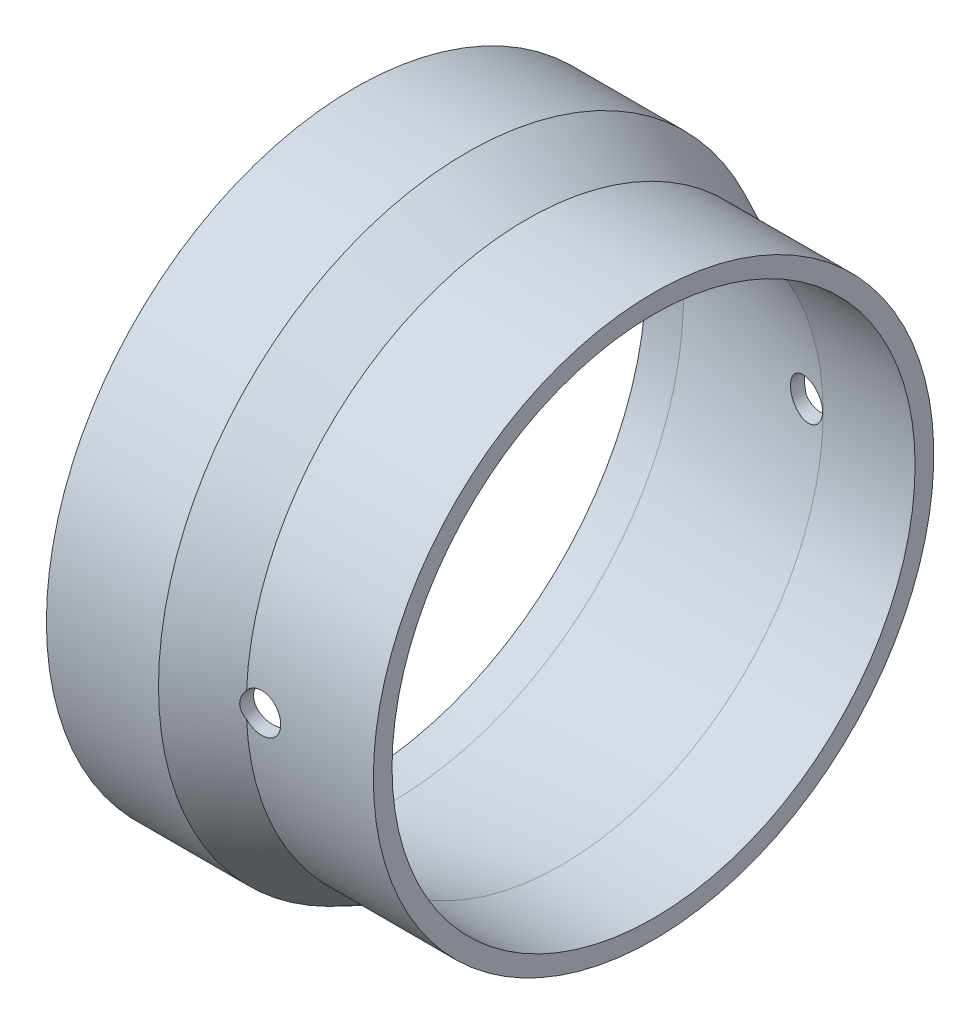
ISO-10303-21;
HEADER;
FILE_DESCRIPTION(('STEP AP214'),'2;1');
FILE_NAME('part.step','',(''),(''),'','','');
FILE_SCHEMA(('AUTOMOTIVE_DESIGN { 1 0 10303 214 1 1 1 1 }'));
ENDSEC;
DATA;
#1=APPLICATION_CONTEXT('core data for automotive mechanical design processes');
#2=APPLICATION_PROTOCOL_DEFINITION('international standard','automotive_design',2000,#1);
#3=PRODUCT_CONTEXT('',#1,'mechanical');
#4=PRODUCT('Part','Part','',(#3));
#5=PRODUCT_RELATED_PRODUCT_CATEGORY('part','',(#4));
#6=PRODUCT_DEFINITION_FORMATION('','',#4);
#7=PRODUCT_DEFINITION_CONTEXT('part definition',#1,'design');
#8=PRODUCT_DEFINITION('design','',#6,#7);
#9=PRODUCT_DEFINITION_SHAPE('','',#8);
#10=(LENGTH_UNIT() NAMED_UNIT(*) SI_UNIT(.MILLI.,.METRE.));
#11=(NAMED_UNIT(*) PLANE_ANGLE_UNIT() SI_UNIT($,.RADIAN.));
#12=(NAMED_UNIT(*) SI_UNIT($,.STERADIAN.) SOLID_ANGLE_UNIT());
#13=UNCERTAINTY_MEASURE_WITH_UNIT(LENGTH_MEASURE(1.E-05),#10,'distance_accuracy_value','');
#14=(GEOMETRIC_REPRESENTATION_CONTEXT(3) GLOBAL_UNCERTAINTY_ASSIGNED_CONTEXT((#13)) GLOBAL_UNIT_ASSIGNED_CONTEXT((#10,
#11,#12)) REPRESENTATION_CONTEXT('',''));
#15=CARTESIAN_POINT('',(0.,0.,0.));
#16=DIRECTION('',(0.,0.,1.));
#17=DIRECTION('',(1.,0.,0.));
#18=AXIS2_PLACEMENT_3D('',#15,#16,#17);
#19=CARTESIAN_POINT('',(-26.3725469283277,0.,0.));
#20=DIRECTION('',(-1.,0.,0.));
#21=DIRECTION('',(0.,0.,1.));
#22=AXIS2_PLACEMENT_3D('',#19,#20,#21);
#23=CYLINDRICAL_SURFACE('',#22,26.19375);
#24=CARTESIAN_POINT('',(0.,0.,0.));
#25=DIRECTION('',(-1.,0.,0.));
#26=DIRECTION('',(0.,0.,1.));
#27=AXIS2_PLACEMENT_3D('',#24,#25,#26);
#28=CIRCLE('',#27,26.19375);
#29=CARTESIAN_POINT('',(0.,0.,26.19375));
#30=VERTEX_POINT('',#29);
#31=EDGE_CURVE('E72',#30,#30,#28,.T.);
#32=ORIENTED_EDGE('',*,*,#31,.F.);
#33=EDGE_LOOP('',(#32));
#34=FACE_BOUND('',#33,.T.);
#35=CARTESIAN_POINT('',(9.525,0.,0.));
#36=DIRECTION('',(-1.,0.,0.));
#37=DIRECTION('',(0.,0.,1.));
#38=AXIS2_PLACEMENT_3D('',#35,#36,#37);
#39=CIRCLE('',#38,26.19375);
#40=CARTESIAN_POINT('',(9.525,0.,26.19375));
#41=VERTEX_POINT('',#40);
#42=EDGE_CURVE('E86',#41,#41,#39,.T.);
#43=ORIENTED_EDGE('',*,*,#42,.T.);
#44=EDGE_LOOP('',(#43));
#45=FACE_BOUND('',#44,.T.);
#46=ADVANCED_FACE('F36',(#34,#45),#23,.T.);
#47=CARTESIAN_POINT('',(0.,26.19375,0.));
#48=DIRECTION('',(1.,0.,0.));
#49=DIRECTION('',(0.,0.,-1.));
#50=AXIS2_PLACEMENT_3D('',#47,#48,#49);
#51=PLANE('',#50);
#52=CARTESIAN_POINT('',(0.,0.,0.));
#53=DIRECTION('',(-1.,0.,0.));
#54=DIRECTION('',(0.,0.,1.));
#55=AXIS2_PLACEMENT_3D('',#52,#53,#54);
#56=CIRCLE('',#55,24.765);
#57=CARTESIAN_POINT('',(0.,0.,24.765));
#58=VERTEX_POINT('',#57);
#59=EDGE_CURVE('E98',#58,#58,#56,.T.);
#60=ORIENTED_EDGE('',*,*,#59,.F.);
#61=EDGE_LOOP('',(#60));
#62=FACE_BOUND('',#61,.T.);
#63=ORIENTED_EDGE('',*,*,#31,.T.);
#64=EDGE_LOOP('',(#63));
#65=FACE_BOUND('',#64,.T.);
#66=ADVANCED_FACE('F147',(#62,#65),#51,.F.);
#67=CARTESIAN_POINT('',(-26.3725469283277,0.,0.));
#68=DIRECTION('',(-1.,0.,0.));
#69=DIRECTION('',(0.,0.,1.));
#70=AXIS2_PLACEMENT_3D('',#67,#68,#69);
#71=CYLINDRICAL_SURFACE('',#70,24.765);
#72=CARTESIAN_POINT('',(3.175,0.,0.));
#73=DIRECTION('',(-1.,0.,0.));
#74=DIRECTION('',(0.,0.,1.));
#75=AXIS2_PLACEMENT_3D('',#72,#73,#74);
#76=CIRCLE('',#75,24.765);
#77=CARTESIAN_POINT('',(3.175,0.,24.765));
#78=VERTEX_POINT('',#77);
#79=EDGE_CURVE('E95',#78,#78,#76,.T.);
#80=ORIENTED_EDGE('',*,*,#79,.F.);
#81=EDGE_LOOP('',(#80));
#82=FACE_BOUND('',#81,.T.);
#83=ORIENTED_EDGE('',*,*,#59,.T.);
#84=EDGE_LOOP('',(#83));
#85=FACE_BOUND('',#84,.T.);
#86=ADVANCED_FACE('F142',(#82,#85),#71,.F.);
#87=CARTESIAN_POINT('',(3.175,0.,0.));
#88=DIRECTION('',(-1.,0.,0.));
#89=DIRECTION('',(0.,0.,1.));
#90=AXIS2_PLACEMENT_3D('',#87,#88,#89);
#91=CONICAL_SURFACE('',#90,24.765,0.174532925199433);
#92=CARTESIAN_POINT('',(14.5232093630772,-0.947872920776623,-22.744261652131));
#93=CARTESIAN_POINT('',(14.4712327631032,-0.87374165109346,-22.7565234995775));
#94=CARTESIAN_POINT('',(14.425239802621,-0.795144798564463,-22.767546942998));
#95=CARTESIAN_POINT('',(14.3466697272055,-0.631102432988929,-22.7865438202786));
#96=CARTESIAN_POINT('',(14.3141037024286,-0.54565132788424,-22.794514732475));
#97=CARTESIAN_POINT('',(14.2634653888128,-0.370255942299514,-22.806968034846));
#98=CARTESIAN_POINT('',(14.2453999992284,-0.280309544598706,-22.8114487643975));
#99=CARTESIAN_POINT('',(14.2244097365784,-0.0985780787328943,-22.8166588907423));
#100=CARTESIAN_POINT('',(14.2214813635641,-0.00679344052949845,-22.8173891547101));
#101=CARTESIAN_POINT('',(14.230793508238,0.174764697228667,-22.8150743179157));
#102=CARTESIAN_POINT('',(14.2428393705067,0.26454887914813,-22.8120776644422));
#103=CARTESIAN_POINT('',(14.2813685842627,0.44076642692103,-22.8025585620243));
#104=CARTESIAN_POINT('',(14.3078523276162,0.527199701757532,-22.7960360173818));
#105=CARTESIAN_POINT('',(14.37449664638,0.6945700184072,-22.779795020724));
#106=CARTESIAN_POINT('',(14.4146947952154,0.775491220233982,-22.7700677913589));
#107=CARTESIAN_POINT('',(14.5075176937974,0.929449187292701,-22.747922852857));
#108=CARTESIAN_POINT('',(14.5601437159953,1.00248514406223,-22.7355048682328));
#109=CARTESIAN_POINT('',(14.6776048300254,1.14036356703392,-22.7082738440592));
#110=CARTESIAN_POINT('',(14.7426860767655,1.2049869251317,-22.6934135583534));
#111=CARTESIAN_POINT('',(14.8824109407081,1.32246066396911,-22.6621922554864));
#112=CARTESIAN_POINT('',(14.9570558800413,1.37530941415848,-22.6458310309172));
#113=CARTESIAN_POINT('',(15.115888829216,1.46910525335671,-22.6118771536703));
#114=CARTESIAN_POINT('',(15.2002707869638,1.50971667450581,-22.59426379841));
#115=CARTESIAN_POINT('',(15.3746540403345,1.57612232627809,-22.5589056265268));
#116=CARTESIAN_POINT('',(15.4646557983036,1.60191533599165,-22.5411607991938));
#117=CARTESIAN_POINT('',(15.6489220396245,1.63817294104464,-22.5059783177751));
#118=CARTESIAN_POINT('',(15.7432246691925,1.64845023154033,-22.4885468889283));
#119=CARTESIAN_POINT('',(15.9323973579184,1.65271197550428,-22.4547878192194));
#120=CARTESIAN_POINT('',(16.0272674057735,1.64669675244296,-22.4384601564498));
#121=CARTESIAN_POINT('',(16.2143187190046,1.61850574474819,-22.4074430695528));
#122=CARTESIAN_POINT('',(16.3065117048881,1.59641708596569,-22.3927453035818));
#123=CARTESIAN_POINT('',(16.4860087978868,1.53668920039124,-22.3651984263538));
#124=CARTESIAN_POINT('',(16.5733132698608,1.49905113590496,-22.3523491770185));
#125=CARTESIAN_POINT('',(16.7392233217,1.40984644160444,-22.3288387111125));
#126=CARTESIAN_POINT('',(16.8179329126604,1.35848060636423,-22.3181495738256));
#127=CARTESIAN_POINT('',(16.9656549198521,1.24300445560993,-22.2987905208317));
#128=CARTESIAN_POINT('',(17.0346679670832,1.1788949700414,-22.2901204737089));
#129=CARTESIAN_POINT('',(17.1601516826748,1.04057840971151,-22.2748524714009));
#130=CARTESIAN_POINT('',(17.2167607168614,0.966499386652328,-22.2682312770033));
#131=CARTESIAN_POINT('',(17.3167699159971,0.809777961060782,-22.2568346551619));
#132=CARTESIAN_POINT('',(17.3601705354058,0.727135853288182,-22.2520591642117));
#133=CARTESIAN_POINT('',(17.4322496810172,0.556173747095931,-22.2442727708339));
#134=CARTESIAN_POINT('',(17.4610150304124,0.467890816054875,-22.2412514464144));
#135=CARTESIAN_POINT('',(17.5033683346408,0.287717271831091,-22.2368429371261));
#136=CARTESIAN_POINT('',(17.5169564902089,0.195826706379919,-22.2354557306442));
#137=CARTESIAN_POINT('',(17.5285444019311,0.0112430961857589,-22.2342711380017));
#138=CARTESIAN_POINT('',(17.5265752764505,-0.0814479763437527,-22.2344705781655));
#139=CARTESIAN_POINT('',(17.5071805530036,-0.265181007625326,-22.2364584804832));
#140=CARTESIAN_POINT('',(17.4897550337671,-0.35622297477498,-22.2382469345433));
#141=CARTESIAN_POINT('',(17.4399646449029,-0.534050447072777,-22.2434691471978));
#142=CARTESIAN_POINT('',(17.4076036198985,-0.62083704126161,-22.2469024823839));
#143=CARTESIAN_POINT('',(17.3288936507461,-0.787721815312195,-22.2555063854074));
#144=CARTESIAN_POINT('',(17.2825447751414,-0.867820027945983,-22.2606769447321));
#145=CARTESIAN_POINT('',(17.177167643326,-1.01915178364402,-22.2728629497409));
#146=CARTESIAN_POINT('',(17.1181265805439,-1.09037625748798,-22.279880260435));
#147=CARTESIAN_POINT('',(16.9891304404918,-1.22188310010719,-22.2958352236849));
#148=CARTESIAN_POINT('',(16.9191752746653,-1.28216538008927,-22.3047728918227));
#149=CARTESIAN_POINT('',(16.7701129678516,-1.39035500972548,-22.3246259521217));
#150=CARTESIAN_POINT('',(16.6909720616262,-1.43821446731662,-22.3355487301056));
#151=CARTESIAN_POINT('',(16.5260550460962,-1.52000044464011,-22.3592788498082));
#152=CARTESIAN_POINT('',(16.4402786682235,-1.5539264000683,-22.3720862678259));
#153=CARTESIAN_POINT('',(16.2637401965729,-1.60725260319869,-22.3995275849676));
#154=CARTESIAN_POINT('',(16.1729400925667,-1.6265189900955,-22.4141769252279));
#155=CARTESIAN_POINT('',(15.9896375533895,-1.64960428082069,-22.4448982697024));
#156=CARTESIAN_POINT('',(15.8971350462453,-1.65342253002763,-22.4609703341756));
#157=CARTESIAN_POINT('',(15.7117058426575,-1.64555908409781,-22.4943314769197));
#158=CARTESIAN_POINT('',(15.6187906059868,-1.63366499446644,-22.5116341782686));
#159=CARTESIAN_POINT('',(15.4363530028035,-1.59439612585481,-22.5466983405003));
#160=CARTESIAN_POINT('',(15.3468317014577,-1.5670165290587,-22.5644599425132));
#161=CARTESIAN_POINT('',(15.1726439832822,-1.49713346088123,-22.59998617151));
#162=CARTESIAN_POINT('',(15.0880464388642,-1.45445717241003,-22.6177484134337));
#163=CARTESIAN_POINT('',(14.9273057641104,-1.35520491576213,-22.6523051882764));
#164=CARTESIAN_POINT('',(14.8511535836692,-1.29864403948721,-22.6691007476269));
#165=CARTESIAN_POINT('',(14.7321494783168,-1.19324974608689,-22.6958574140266));
#166=CARTESIAN_POINT('',(14.686432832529,-1.14772314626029,-22.7062873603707));
#167=CARTESIAN_POINT('',(14.6005293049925,-1.05151501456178,-22.7261094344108));
#168=CARTESIAN_POINT('',(14.5603423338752,-1.00083356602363,-22.735501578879));
#169=CARTESIAN_POINT('',(14.5232093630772,-0.947872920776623,-22.744261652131));
#170=B_SPLINE_CURVE_WITH_KNOTS('',3,(#92,#93,#94,#95,#96,#97,#98,#99,#100,#101,#102,#103,#104,
#105,#106,#107,#108,#109,#110,#111,#112,#113,#114,#115,#116,#117,#118,#119,#120,#121,#122,#123,
#124,#125,#126,#127,#128,#129,#130,#131,#132,#133,#134,#135,#136,#137,#138,#139,#140,#141,#142,
#143,#144,#145,#146,#147,#148,#149,#150,#151,#152,#153,#154,#155,#156,#157,#158,#159,#160,#161,
#162,#163,#164,#165,#166,#167,#168,#169),.UNSPECIFIED.,.T.,.F.,(4,2,2,2,2,2,2,2,2,2,2,2,2,2,2,2,
2,2,2,2,2,2,2,2,2,2,2,2,2,2,2,2,2,2,2,2,2,2,4),(0.,0.273861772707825,0.547949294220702,
0.822167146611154,1.09632159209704,1.36694918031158,1.63758411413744,1.90896654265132,
2.18037676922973,2.4578411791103,2.73534398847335,3.01988147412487,3.3044423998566,
3.59241180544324,3.88037549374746,4.16678979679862,4.45318269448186,4.73559634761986,
5.01799161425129,5.29705526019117,5.57610930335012,5.85348797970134,6.13086298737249,
6.40768331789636,6.68450223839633,6.96124994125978,7.23799628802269,7.51502319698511,
7.79205235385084,8.07013415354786,8.34822721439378,8.62883012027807,8.90944491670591,
9.19389206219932,9.47842775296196,9.76628496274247,10.0538306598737,10.2494853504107,
10.4451368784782),.UNSPECIFIED.);
#171=CARTESIAN_POINT('',(14.5232093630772,-0.947872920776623,-22.744261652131));
#172=VERTEX_POINT('',#171);
#173=EDGE_CURVE('E132',#172,#172,#170,.T.);
#174=ORIENTED_EDGE('',*,*,#173,.T.);
#175=EDGE_LOOP('',(#174));
#176=FACE_BOUND('',#175,.T.);
#177=CARTESIAN_POINT('',(14.5232093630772,-0.947872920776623,22.744261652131));
#178=CARTESIAN_POINT('',(14.5771465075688,-1.0247867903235,22.7315371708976));
#179=CARTESIAN_POINT('',(14.6376028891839,-1.09699957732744,22.7174614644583));
#180=CARTESIAN_POINT('',(14.7696904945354,-1.23000058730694,22.6873252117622));
#181=CARTESIAN_POINT('',(14.8413381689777,-1.29077169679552,22.6712617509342));
#182=CARTESIAN_POINT('',(14.9935898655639,-1.39915458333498,22.6379339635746));
#183=CARTESIAN_POINT('',(15.0741822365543,-1.4467832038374,22.6206712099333));
#184=CARTESIAN_POINT('',(15.2421271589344,-1.52773108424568,22.5856680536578));
#185=CARTESIAN_POINT('',(15.3294778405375,-1.56105428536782,22.5679277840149));
#186=CARTESIAN_POINT('',(15.5096652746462,-1.61283055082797,22.5324342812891));
#187=CARTESIAN_POINT('',(15.6025554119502,-1.63109977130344,22.514683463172));
#188=CARTESIAN_POINT('',(15.7902513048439,-1.65152371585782,22.4800097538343));
#189=CARTESIAN_POINT('',(15.8850571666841,-1.65367754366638,22.4630869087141));
#190=CARTESIAN_POINT('',(16.0737320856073,-1.64171485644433,22.4306070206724));
#191=CARTESIAN_POINT('',(16.1676023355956,-1.62762276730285,22.4150479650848));
#192=CARTESIAN_POINT('',(16.3517971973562,-1.58348737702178,22.3856493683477));
#193=CARTESIAN_POINT('',(16.4421220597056,-1.55344520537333,22.3718097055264));
#194=CARTESIAN_POINT('',(16.615379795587,-1.47865709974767,22.3462593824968));
#195=CARTESIAN_POINT('',(16.6983930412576,-1.43410598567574,22.3345235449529));
#196=CARTESIAN_POINT('',(16.8558199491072,-1.33139930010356,22.3130729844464));
#197=CARTESIAN_POINT('',(16.930234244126,-1.27324473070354,22.3033581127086));
#198=CARTESIAN_POINT('',(17.0672970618,-1.14580642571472,22.2860655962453));
#199=CARTESIAN_POINT('',(17.1300858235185,-1.07667701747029,22.2784618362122));
#200=CARTESIAN_POINT('',(17.2431954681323,-0.928715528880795,22.2651581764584));
#201=CARTESIAN_POINT('',(17.293516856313,-0.849883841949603,22.2594581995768));
#202=CARTESIAN_POINT('',(17.3798599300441,-0.685392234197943,22.2498957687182));
#203=CARTESIAN_POINT('',(17.415984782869,-0.599787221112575,22.2460200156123));
#204=CARTESIAN_POINT('',(17.4733964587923,-0.423682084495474,22.2399453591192));
#205=CARTESIAN_POINT('',(17.4946835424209,-0.333182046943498,22.2377464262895));
#206=CARTESIAN_POINT('',(17.5217549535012,-0.150122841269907,22.2349609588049));
#207=CARTESIAN_POINT('',(17.5275816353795,-0.0575700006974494,22.2343700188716));
#208=CARTESIAN_POINT('',(17.5236840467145,0.127204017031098,22.2347679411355));
#209=CARTESIAN_POINT('',(17.5139598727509,0.219425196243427,22.2357567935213));
#210=CARTESIAN_POINT('',(17.4792555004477,0.400863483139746,22.2393461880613));
#211=CARTESIAN_POINT('',(17.4542839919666,0.490082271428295,22.2419458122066));
#212=CARTESIAN_POINT('',(17.3898248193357,0.663041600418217,22.2488330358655));
#213=CARTESIAN_POINT('',(17.3503372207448,0.746782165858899,22.2531206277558));
#214=CARTESIAN_POINT('',(17.2579765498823,0.906471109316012,22.2634876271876));
#215=CARTESIAN_POINT('',(17.2050950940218,0.982414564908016,22.2695681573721));
#216=CARTESIAN_POINT('',(17.0875155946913,1.12432103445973,22.2836140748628));
#217=CARTESIAN_POINT('',(17.0228175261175,1.19028402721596,22.2915794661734));
#218=CARTESIAN_POINT('',(16.8833015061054,1.31058677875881,22.3094738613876));
#219=CARTESIAN_POINT('',(16.8084550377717,1.3648926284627,22.3194084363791));
#220=CARTESIAN_POINT('',(16.6509727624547,1.46018446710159,22.34120487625));
#221=CARTESIAN_POINT('',(16.5683367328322,1.50117007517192,22.3530667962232));
#222=CARTESIAN_POINT('',(16.3970043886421,1.56903357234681,22.3786911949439));
#223=CARTESIAN_POINT('',(16.3082670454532,1.5958026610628,22.3924673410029));
#224=CARTESIAN_POINT('',(16.1278200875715,1.63413363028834,22.4216049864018));
#225=CARTESIAN_POINT('',(16.0361102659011,1.64569444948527,22.4369665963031));
#226=CARTESIAN_POINT('',(15.8510654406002,1.65345517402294,22.4691128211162));
#227=CARTESIAN_POINT('',(15.7577247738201,1.64945415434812,22.4859132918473));
#228=CARTESIAN_POINT('',(15.5731776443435,1.62584143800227,22.5202582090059));
#229=CARTESIAN_POINT('',(15.4819713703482,1.60622836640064,22.5378027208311));
#230=CARTESIAN_POINT('',(15.3030233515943,1.55161428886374,22.5732566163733));
#231=CARTESIAN_POINT('',(15.2153415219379,1.51641792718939,22.591167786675));
#232=CARTESIAN_POINT('',(15.0471532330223,1.43155292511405,22.6264192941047));
#233=CARTESIAN_POINT('',(14.9666470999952,1.3818836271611,22.6437596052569));
#234=CARTESIAN_POINT('',(14.8149702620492,1.26928098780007,22.6771368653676));
#235=CARTESIAN_POINT('',(14.7438162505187,1.20632443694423,22.6931714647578));
#236=CARTESIAN_POINT('',(14.6131423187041,1.06888032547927,22.723126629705));
#237=CARTESIAN_POINT('',(14.5536214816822,0.99439367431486,22.7370473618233));
#238=CARTESIAN_POINT('',(14.4489725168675,0.837263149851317,22.7618354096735));
#239=CARTESIAN_POINT('',(14.4036232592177,0.754774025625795,22.7727492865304));
#240=CARTESIAN_POINT('',(14.3274996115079,0.58297964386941,22.7912209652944));
#241=CARTESIAN_POINT('',(14.2967220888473,0.493675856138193,22.7987794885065));
#242=CARTESIAN_POINT('',(14.2514213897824,0.313371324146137,22.8099491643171));
#243=CARTESIAN_POINT('',(14.2364825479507,0.222481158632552,22.8136612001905));
#244=CARTESIAN_POINT('',(14.2219176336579,0.0393864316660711,22.8172799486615));
#245=CARTESIAN_POINT('',(14.2222934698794,-0.0528182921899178,22.817186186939));
#246=CARTESIAN_POINT('',(14.2382063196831,-0.23422632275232,22.8132333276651));
#247=CARTESIAN_POINT('',(14.253485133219,-0.323454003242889,22.8094383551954));
#248=CARTESIAN_POINT('',(14.298310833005,-0.497944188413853,22.7983898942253));
#249=CARTESIAN_POINT('',(14.3278409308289,-0.583211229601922,22.7911404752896));
#250=CARTESIAN_POINT('',(14.3858605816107,-0.714995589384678,22.7770581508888));
#251=CARTESIAN_POINT('',(14.4101525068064,-0.763513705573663,22.7711921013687));
#252=CARTESIAN_POINT('',(14.4633137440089,-0.857830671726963,22.7584536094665));
#253=CARTESIAN_POINT('',(14.492182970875,-0.903629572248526,22.7515811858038));
#254=CARTESIAN_POINT('',(14.5232093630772,-0.947872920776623,22.744261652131));
#255=B_SPLINE_CURVE_WITH_KNOTS('',3,(#177,#178,#179,#180,#181,#182,#183,#184,#185,#186,#187,
#188,#189,#190,#191,#192,#193,#194,#195,#196,#197,#198,#199,#200,#201,#202,#203,#204,#205,#206,
#207,#208,#209,#210,#211,#212,#213,#214,#215,#216,#217,#218,#219,#220,#221,#222,#223,#224,#225,
#226,#227,#228,#229,#230,#231,#232,#233,#234,#235,#236,#237,#238,#239,#240,#241,#242,#243,#244,
#245,#246,#247,#248,#249,#250,#251,#252,#253,#254),.UNSPECIFIED.,.T.,.F.,(4,2,2,2,2,2,2,2,2,2,2,
2,2,2,2,2,2,2,2,2,2,2,2,2,2,2,2,2,2,2,2,2,2,2,2,2,2,2,4),(0.,0.284193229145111,
0.568808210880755,0.853056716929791,1.13722686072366,1.4248179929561,1.71242511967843,
1.9996003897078,2.28675532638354,2.57020332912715,2.85363045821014,3.13337706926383,
3.41311234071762,3.69077540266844,3.96843358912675,4.24533033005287,4.52222535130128,
4.7989627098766,5.07569881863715,5.35260857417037,5.62951891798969,5.90722415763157,
6.18493733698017,6.46474632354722,6.74457483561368,7.02802824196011,7.31150661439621,
7.59864405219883,7.88579453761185,8.17345081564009,8.46108441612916,8.74397542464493,
9.0268055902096,9.30201416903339,9.57725704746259,9.8478144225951,10.1180538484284,
10.281534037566,10.445011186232),.UNSPECIFIED.);
#256=CARTESIAN_POINT('',(14.5232093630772,-0.947872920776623,22.744261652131));
#257=VERTEX_POINT('',#256);
#258=EDGE_CURVE('E126',#257,#257,#255,.T.);
#259=ORIENTED_EDGE('',*,*,#258,.T.);
#260=EDGE_LOOP('',(#259));
#261=FACE_BOUND('',#260,.T.);
#262=CARTESIAN_POINT('',(17.580055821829,0.,0.));
#263=DIRECTION('',(-1.,0.,0.));
#264=DIRECTION('',(0.,0.,1.));
#265=AXIS2_PLACEMENT_3D('',#262,#263,#264);
#266=CIRCLE('',#265,22.225);
#267=CARTESIAN_POINT('',(17.580055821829,0.,22.225));
#268=VERTEX_POINT('',#267);
#269=EDGE_CURVE('E92',#268,#268,#266,.T.);
#270=ORIENTED_EDGE('',*,*,#269,.F.);
#271=EDGE_LOOP('',(#270));
#272=FACE_BOUND('',#271,.T.);
#273=ORIENTED_EDGE('',*,*,#79,.T.);
#274=EDGE_LOOP('',(#273));
#275=FACE_BOUND('',#274,.T.);
#276=ADVANCED_FACE('F136',(#176,#261,#272,#275),#91,.F.);
#277=CARTESIAN_POINT('',(-26.3725469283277,0.,0.));
#278=DIRECTION('',(-1.,0.,0.));
#279=DIRECTION('',(0.,0.,1.));
#280=AXIS2_PLACEMENT_3D('',#277,#278,#279);
#281=CYLINDRICAL_SURFACE('',#280,22.225);
#282=CARTESIAN_POINT('',(25.4,0.,0.));
#283=DIRECTION('',(-1.,0.,0.));
#284=DIRECTION('',(0.,0.,1.));
#285=AXIS2_PLACEMENT_3D('',#282,#283,#284);
#286=CIRCLE('',#285,22.225);
#287=CARTESIAN_POINT('',(25.4,0.,22.225));
#288=VERTEX_POINT('',#287);
#289=EDGE_CURVE('E84',#288,#288,#286,.T.);
#290=ORIENTED_EDGE('',*,*,#289,.F.);
#291=EDGE_LOOP('',(#290));
#292=FACE_BOUND('',#291,.T.);
#293=ORIENTED_EDGE('',*,*,#269,.T.);
#294=EDGE_LOOP('',(#293));
#295=FACE_BOUND('',#294,.T.);
#296=ADVANCED_FACE('F141',(#292,#295),#281,.F.);
#297=CARTESIAN_POINT('',(25.4,22.225,0.));
#298=DIRECTION('',(-1.,0.,0.));
#299=DIRECTION('',(0.,0.,1.));
#300=AXIS2_PLACEMENT_3D('',#297,#298,#299);
#301=PLANE('',#300);
#302=CARTESIAN_POINT('',(25.4,0.,0.));
#303=DIRECTION('',(-1.,0.,0.));
#304=DIRECTION('',(0.,0.,1.));
#305=AXIS2_PLACEMENT_3D('',#302,#303,#304);
#306=CIRCLE('',#305,23.8125);
#307=CARTESIAN_POINT('',(25.4,0.,23.8125));
#308=VERTEX_POINT('',#307);
#309=EDGE_CURVE('E81',#308,#308,#306,.T.);
#310=ORIENTED_EDGE('',*,*,#309,.F.);
#311=EDGE_LOOP('',(#310));
#312=FACE_BOUND('',#311,.T.);
#313=ORIENTED_EDGE('',*,*,#289,.T.);
#314=EDGE_LOOP('',(#313));
#315=FACE_BOUND('',#314,.T.);
#316=ADVANCED_FACE('F173',(#312,#315),#301,.F.);
#317=CARTESIAN_POINT('',(-26.3725469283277,0.,0.));
#318=DIRECTION('',(-1.,0.,0.));
#319=DIRECTION('',(0.,0.,1.));
#320=AXIS2_PLACEMENT_3D('',#317,#318,#319);
#321=CYLINDRICAL_SURFACE('',#320,23.8125);
#322=CARTESIAN_POINT('',(14.605,0.,0.));
#323=DIRECTION('',(-1.,0.,0.));
#324=DIRECTION('',(0.,0.,1.));
#325=AXIS2_PLACEMENT_3D('',#322,#323,#324);
#326=CIRCLE('',#325,23.8125);
#327=CARTESIAN_POINT('',(14.605,-1.05494123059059,-23.7891205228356));
#328=VERTEX_POINT('',#327);
#329=CARTESIAN_POINT('',(14.605,-1.05494123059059,23.7891205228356));
#330=VERTEX_POINT('',#329);
#331=EDGE_CURVE('E78',#328,#330,#326,.T.);
#332=ORIENTED_EDGE('',*,*,#331,.F.);
#333=CARTESIAN_POINT('',(14.605,-1.05494123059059,-23.7891205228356));
#334=CARTESIAN_POINT('',(14.6346804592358,-1.09067170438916,-23.7875361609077));
#335=CARTESIAN_POINT('',(14.6658543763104,-1.12513153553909,-23.785927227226));
#336=CARTESIAN_POINT('',(14.7309911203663,-1.19130276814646,-23.7827048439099));
#337=CARTESIAN_POINT('',(14.7649538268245,-1.22301428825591,-23.7810913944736));
#338=CARTESIAN_POINT('',(14.8706256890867,-1.31362883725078,-23.776315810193));
#339=CARTESIAN_POINT('',(14.9462094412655,-1.3681210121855,-23.77321338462));
#340=CARTESIAN_POINT('',(15.1054679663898,-1.46364599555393,-23.7675241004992));
#341=CARTESIAN_POINT('',(15.1891467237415,-1.50467213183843,-23.7649374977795));
#342=CARTESIAN_POINT('',(15.3622162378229,-1.57209130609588,-23.7605730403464));
#343=CARTESIAN_POINT('',(15.4516056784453,-1.59848770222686,-23.7587950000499));
#344=CARTESIAN_POINT('',(15.6334397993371,-1.63586532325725,-23.7562508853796));
#345=CARTESIAN_POINT('',(15.7258803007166,-1.64686680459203,-23.7554834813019));
#346=CARTESIAN_POINT('',(15.9113141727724,-1.65320575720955,-23.7550432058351));
#347=CARTESIAN_POINT('',(16.0043076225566,-1.64854093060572,-23.7553704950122));
#348=CARTESIAN_POINT('',(16.1880288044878,-1.62369721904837,-23.7570813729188));
#349=CARTESIAN_POINT('',(16.2787600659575,-1.60354429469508,-23.758463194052));
#350=CARTESIAN_POINT('',(16.4555436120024,-1.54833613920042,-23.7621247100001));
#351=CARTESIAN_POINT('',(16.5415961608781,-1.51328175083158,-23.7644043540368));
#352=CARTESIAN_POINT('',(16.7066871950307,-1.42922585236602,-23.7696074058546));
#353=CARTESIAN_POINT('',(16.7857182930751,-1.38020987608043,-23.7725314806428));
#354=CARTESIAN_POINT('',(16.9344432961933,-1.26963300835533,-23.7786930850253));
#355=CARTESIAN_POINT('',(17.0041368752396,-1.20807167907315,-23.7819306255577));
#356=CARTESIAN_POINT('',(17.1323565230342,-1.07400047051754,-23.7883623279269));
#357=CARTESIAN_POINT('',(17.1908592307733,-1.00146824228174,-23.7915563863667));
#358=CARTESIAN_POINT('',(17.2948597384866,-0.847597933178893,-23.7975345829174));
#359=CARTESIAN_POINT('',(17.3403576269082,-0.766259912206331,-23.8003187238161));
#360=CARTESIAN_POINT('',(17.4170480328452,-0.597087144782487,-23.805163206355));
#361=CARTESIAN_POINT('',(17.4482419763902,-0.509253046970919,-23.8072236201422));
#362=CARTESIAN_POINT('',(17.4954343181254,-0.329576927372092,-23.8103885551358));
#363=CARTESIAN_POINT('',(17.5114329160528,-0.237734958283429,-23.8114930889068));
#364=CARTESIAN_POINT('',(17.5277554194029,-0.0528577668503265,-23.8126203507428));
#365=CARTESIAN_POINT('',(17.5281123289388,0.0401745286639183,-23.8126453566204));
#366=CARTESIAN_POINT('',(17.5132246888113,0.224975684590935,-23.8116165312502));
#367=CARTESIAN_POINT('',(17.4979802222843,0.316744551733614,-23.8105627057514));
#368=CARTESIAN_POINT('',(17.4523480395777,0.496337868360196,-23.8074960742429));
#369=CARTESIAN_POINT('',(17.4219728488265,0.584165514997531,-23.8054840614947));
#370=CARTESIAN_POINT('',(17.3469532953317,0.753477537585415,-23.800727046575));
#371=CARTESIAN_POINT('',(17.3023087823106,0.83496184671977,-23.7979820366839));
#372=CARTESIAN_POINT('',(17.1999269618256,0.989429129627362,-23.7920612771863));
#373=CARTESIAN_POINT('',(17.1421670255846,1.06239707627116,-23.7888847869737));
#374=CARTESIAN_POINT('',(17.0152299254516,1.19761264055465,-23.7824614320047));
#375=CARTESIAN_POINT('',(16.9460525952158,1.25986010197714,-23.7792145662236));
#376=CARTESIAN_POINT('',(16.7981103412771,1.3719678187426,-23.7730104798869));
#377=CARTESIAN_POINT('',(16.7193301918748,1.42180801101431,-23.7700537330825));
#378=CARTESIAN_POINT('',(16.5545000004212,1.5075512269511,-23.764770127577));
#379=CARTESIAN_POINT('',(16.4684500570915,1.54345443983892,-23.7624432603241));
#380=CARTESIAN_POINT('',(16.2916133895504,1.60026562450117,-23.7586851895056));
#381=CARTESIAN_POINT('',(16.200831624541,1.62118896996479,-23.7572530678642));
#382=CARTESIAN_POINT('',(16.0170344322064,1.64749659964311,-23.7554433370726));
#383=CARTESIAN_POINT('',(15.9240190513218,1.65288120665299,-23.7550657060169));
#384=CARTESIAN_POINT('',(15.7386059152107,1.64796257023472,-23.7554074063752));
#385=CARTESIAN_POINT('',(15.6462072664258,1.63769271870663,-23.7561244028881));
#386=CARTESIAN_POINT('',(15.4644353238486,1.60181744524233,-23.7585701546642));
#387=CARTESIAN_POINT('',(15.375062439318,1.5762099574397,-23.7602990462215));
#388=CARTESIAN_POINT('',(15.2018530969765,1.51038636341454,-23.7645738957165));
#389=CARTESIAN_POINT('',(15.1180193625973,1.47016313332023,-23.7671202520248));
#390=CARTESIAN_POINT('',(14.9583273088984,1.37625365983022,-23.7727423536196));
#391=CARTESIAN_POINT('',(14.8824624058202,1.32257865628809,-23.7758176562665));
#392=CARTESIAN_POINT('',(14.7741964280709,1.2314389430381,-23.7806583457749));
#393=CARTESIAN_POINT('',(14.7381354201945,1.19822389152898,-23.7823595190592));
#394=CARTESIAN_POINT('',(14.6691672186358,1.12878558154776,-23.7857563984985));
#395=CARTESIAN_POINT('',(14.6362544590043,1.09256785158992,-23.7874521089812));
#396=CARTESIAN_POINT('',(14.605,1.05494123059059,-23.7891205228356));
#397=B_SPLINE_CURVE_WITH_KNOTS('',3,(#333,#334,#335,#336,#337,#338,#339,#340,#341,#342,#343,
#344,#345,#346,#347,#348,#349,#350,#351,#352,#353,#354,#355,#356,#357,#358,#359,#360,#361,#362,
#363,#364,#365,#366,#367,#368,#369,#370,#371,#372,#373,#374,#375,#376,#377,#378,#379,#380,#381,
#382,#383,#384,#385,#386,#387,#388,#389,#390,#391,#392,#393,#394,#395,#396),.UNSPECIFIED.,.F.,
.F.,(4,2,2,2,2,2,2,2,2,2,2,2,2,2,2,2,2,2,2,2,2,2,2,2,2,2,2,2,2,2,2,4),(0.,0.139345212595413,
0.27868440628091,0.556941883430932,0.835337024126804,1.1136682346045,1.39163287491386,
1.66963828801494,1.94717873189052,2.22470348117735,2.50251683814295,2.7803398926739,
3.05873672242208,3.33713165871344,3.61549883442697,3.89386235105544,4.17163848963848,
4.44941314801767,4.72695824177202,5.00450625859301,5.28253683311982,5.56057145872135,
5.83905279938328,6.11753035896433,6.39572170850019,6.6739072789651,6.95150029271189,
7.22913070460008,7.50689661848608,7.78443120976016,7.93142986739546,8.07816363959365),.UNSPECIFIED.);
#398=CARTESIAN_POINT('',(14.605,1.05494123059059,-23.7891205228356));
#399=VERTEX_POINT('',#398);
#400=EDGE_CURVE('E55',#328,#399,#397,.T.);
#401=ORIENTED_EDGE('',*,*,#400,.T.);
#402=CARTESIAN_POINT('',(14.605,1.05494123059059,23.7891205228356));
#403=VERTEX_POINT('',#402);
#404=EDGE_CURVE('E77',#403,#399,#326,.T.);
#405=ORIENTED_EDGE('',*,*,#404,.F.);
#406=CARTESIAN_POINT('',(14.605,1.05494123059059,23.7891205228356));
#407=CARTESIAN_POINT('',(14.6346804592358,1.09067170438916,23.7875361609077));
#408=CARTESIAN_POINT('',(14.6658543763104,1.12513153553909,23.785927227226));
#409=CARTESIAN_POINT('',(14.7309911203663,1.19130276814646,23.7827048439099));
#410=CARTESIAN_POINT('',(14.7649538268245,1.22301428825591,23.7810913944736));
#411=CARTESIAN_POINT('',(14.8706256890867,1.31362883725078,23.776315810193));
#412=CARTESIAN_POINT('',(14.9462094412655,1.3681210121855,23.77321338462));
#413=CARTESIAN_POINT('',(15.1054679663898,1.46364599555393,23.7675241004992));
#414=CARTESIAN_POINT('',(15.1891467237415,1.50467213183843,23.7649374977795));
#415=CARTESIAN_POINT('',(15.3622162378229,1.57209130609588,23.7605730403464));
#416=CARTESIAN_POINT('',(15.4516056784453,1.59848770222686,23.7587950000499));
#417=CARTESIAN_POINT('',(15.6334397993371,1.63586532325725,23.7562508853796));
#418=CARTESIAN_POINT('',(15.7258803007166,1.64686680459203,23.7554834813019));
#419=CARTESIAN_POINT('',(15.9113141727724,1.65320575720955,23.7550432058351));
#420=CARTESIAN_POINT('',(16.0043076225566,1.64854093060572,23.7553704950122));
#421=CARTESIAN_POINT('',(16.1880288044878,1.62369721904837,23.7570813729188));
#422=CARTESIAN_POINT('',(16.2787600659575,1.60354429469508,23.758463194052));
#423=CARTESIAN_POINT('',(16.4555436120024,1.54833613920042,23.7621247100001));
#424=CARTESIAN_POINT('',(16.5415961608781,1.51328175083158,23.7644043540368));
#425=CARTESIAN_POINT('',(16.7066871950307,1.42922585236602,23.7696074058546));
#426=CARTESIAN_POINT('',(16.7857182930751,1.38020987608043,23.7725314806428));
#427=CARTESIAN_POINT('',(16.9344432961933,1.26963300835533,23.7786930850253));
#428=CARTESIAN_POINT('',(17.0041368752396,1.20807167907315,23.7819306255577));
#429=CARTESIAN_POINT('',(17.1323565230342,1.07400047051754,23.7883623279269));
#430=CARTESIAN_POINT('',(17.1908592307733,1.00146824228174,23.7915563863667));
#431=CARTESIAN_POINT('',(17.2948597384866,0.847597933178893,23.7975345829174));
#432=CARTESIAN_POINT('',(17.3403576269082,0.766259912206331,23.8003187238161));
#433=CARTESIAN_POINT('',(17.4170480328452,0.597087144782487,23.805163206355));
#434=CARTESIAN_POINT('',(17.4482419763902,0.509253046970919,23.8072236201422));
#435=CARTESIAN_POINT('',(17.4954343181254,0.329576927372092,23.8103885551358));
#436=CARTESIAN_POINT('',(17.5114329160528,0.237734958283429,23.8114930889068));
#437=CARTESIAN_POINT('',(17.5277554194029,0.0528577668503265,23.8126203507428));
#438=CARTESIAN_POINT('',(17.5281123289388,-0.0401745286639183,23.8126453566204));
#439=CARTESIAN_POINT('',(17.5132246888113,-0.224975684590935,23.8116165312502));
#440=CARTESIAN_POINT('',(17.4979802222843,-0.316744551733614,23.8105627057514));
#441=CARTESIAN_POINT('',(17.4523480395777,-0.496337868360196,23.8074960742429));
#442=CARTESIAN_POINT('',(17.4219728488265,-0.584165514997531,23.8054840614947));
#443=CARTESIAN_POINT('',(17.3469532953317,-0.753477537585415,23.800727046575));
#444=CARTESIAN_POINT('',(17.3023087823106,-0.83496184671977,23.7979820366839));
#445=CARTESIAN_POINT('',(17.1999269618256,-0.989429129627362,23.7920612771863));
#446=CARTESIAN_POINT('',(17.1421670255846,-1.06239707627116,23.7888847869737));
#447=CARTESIAN_POINT('',(17.0152299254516,-1.19761264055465,23.7824614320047));
#448=CARTESIAN_POINT('',(16.9460525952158,-1.25986010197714,23.7792145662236));
#449=CARTESIAN_POINT('',(16.7981103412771,-1.3719678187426,23.7730104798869));
#450=CARTESIAN_POINT('',(16.7193301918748,-1.42180801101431,23.7700537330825));
#451=CARTESIAN_POINT('',(16.5545000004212,-1.5075512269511,23.764770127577));
#452=CARTESIAN_POINT('',(16.4684500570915,-1.54345443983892,23.7624432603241));
#453=CARTESIAN_POINT('',(16.2916133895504,-1.60026562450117,23.7586851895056));
#454=CARTESIAN_POINT('',(16.200831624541,-1.62118896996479,23.7572530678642));
#455=CARTESIAN_POINT('',(16.0170344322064,-1.64749659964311,23.7554433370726));
#456=CARTESIAN_POINT('',(15.9240190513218,-1.65288120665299,23.7550657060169));
#457=CARTESIAN_POINT('',(15.7386059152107,-1.64796257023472,23.7554074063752));
#458=CARTESIAN_POINT('',(15.6462072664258,-1.63769271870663,23.7561244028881));
#459=CARTESIAN_POINT('',(15.4644353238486,-1.60181744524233,23.7585701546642));
#460=CARTESIAN_POINT('',(15.375062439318,-1.5762099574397,23.7602990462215));
#461=CARTESIAN_POINT('',(15.2018530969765,-1.51038636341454,23.7645738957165));
#462=CARTESIAN_POINT('',(15.1180193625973,-1.47016313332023,23.7671202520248));
#463=CARTESIAN_POINT('',(14.9583273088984,-1.37625365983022,23.7727423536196));
#464=CARTESIAN_POINT('',(14.8824624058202,-1.32257865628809,23.7758176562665));
#465=CARTESIAN_POINT('',(14.7741964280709,-1.2314389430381,23.7806583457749));
#466=CARTESIAN_POINT('',(14.7381354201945,-1.19822389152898,23.7823595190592));
#467=CARTESIAN_POINT('',(14.6691672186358,-1.12878558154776,23.7857563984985));
#468=CARTESIAN_POINT('',(14.6362544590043,-1.09256785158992,23.7874521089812));
#469=CARTESIAN_POINT('',(14.605,-1.05494123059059,23.7891205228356));
#470=B_SPLINE_CURVE_WITH_KNOTS('',3,(#406,#407,#408,#409,#410,#411,#412,#413,#414,#415,#416,
#417,#418,#419,#420,#421,#422,#423,#424,#425,#426,#427,#428,#429,#430,#431,#432,#433,#434,#435,
#436,#437,#438,#439,#440,#441,#442,#443,#444,#445,#446,#447,#448,#449,#450,#451,#452,#453,#454,
#455,#456,#457,#458,#459,#460,#461,#462,#463,#464,#465,#466,#467,#468,#469),.UNSPECIFIED.,.F.,
.F.,(4,2,2,2,2,2,2,2,2,2,2,2,2,2,2,2,2,2,2,2,2,2,2,2,2,2,2,2,2,2,2,4),(0.,0.139345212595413,
0.27868440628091,0.556941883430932,0.835337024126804,1.1136682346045,1.39163287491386,
1.66963828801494,1.94717873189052,2.22470348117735,2.50251683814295,2.7803398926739,
3.05873672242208,3.33713165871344,3.61549883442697,3.89386235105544,4.17163848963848,
4.44941314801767,4.72695824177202,5.00450625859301,5.28253683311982,5.56057145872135,
5.83905279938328,6.11753035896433,6.39572170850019,6.6739072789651,6.95150029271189,
7.22913070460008,7.50689661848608,7.78443120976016,7.93142986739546,8.07816363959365),.UNSPECIFIED.);
#471=EDGE_CURVE('E62',#403,#330,#470,.T.);
#472=ORIENTED_EDGE('',*,*,#471,.T.);
#473=EDGE_LOOP('',(#332,#401,#405,#472));
#474=FACE_BOUND('',#473,.T.);
#475=ORIENTED_EDGE('',*,*,#309,.T.);
#476=EDGE_LOOP('',(#475));
#477=FACE_BOUND('',#476,.T.);
#478=ADVANCED_FACE('F75',(#474,#477),#321,.T.);
#479=CARTESIAN_POINT('',(14.605,0.,0.));
#480=DIRECTION('',(-1.,0.,0.));
#481=DIRECTION('',(0.,0.,1.));
#482=AXIS2_PLACEMENT_3D('',#479,#480,#481);
#483=CONICAL_SURFACE('',#482,23.8125,0.438336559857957);
#484=ORIENTED_EDGE('',*,*,#42,.F.);
#485=EDGE_LOOP('',(#484));
#486=FACE_BOUND('',#485,.T.);
#487=ORIENTED_EDGE('',*,*,#331,.T.);
#488=CARTESIAN_POINT('',(14.6052,-1.05518195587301,23.7890160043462));
#489=CARTESIAN_POINT('',(14.5782458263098,-1.02274341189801,23.8031019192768));
#490=CARTESIAN_POINT('',(14.5524256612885,-0.989142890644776,23.8166386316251));
#491=CARTESIAN_POINT('',(14.5032404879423,-0.919723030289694,23.8424932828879));
#492=CARTESIAN_POINT('',(14.4798766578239,-0.883902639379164,23.8548106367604));
#493=CARTESIAN_POINT('',(14.4137063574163,-0.773181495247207,23.8897764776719));
#494=CARTESIAN_POINT('',(14.374922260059,-0.695141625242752,23.9103857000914));
#495=CARTESIAN_POINT('',(14.3097355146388,-0.53240924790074,23.9451269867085));
#496=CARTESIAN_POINT('',(14.2833719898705,-0.447696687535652,23.959238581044));
#497=CARTESIAN_POINT('',(14.2445463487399,-0.274379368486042,23.9800494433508));
#498=CARTESIAN_POINT('',(14.2320599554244,-0.185781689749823,23.9867616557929));
#499=CARTESIAN_POINT('',(14.2219158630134,-0.0128547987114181,23.992213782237));
#500=CARTESIAN_POINT('',(14.2234137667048,0.071411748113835,23.9914076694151));
#501=CARTESIAN_POINT('',(14.2391551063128,0.238427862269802,23.9829501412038));
#502=CARTESIAN_POINT('',(14.2534034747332,0.321176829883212,23.9752960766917));
#503=CARTESIAN_POINT('',(14.2935320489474,0.481060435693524,23.9538019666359));
#504=CARTESIAN_POINT('',(14.3191638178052,0.558276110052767,23.940094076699));
#505=CARTESIAN_POINT('',(14.3809224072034,0.70712104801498,23.9071982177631));
#506=CARTESIAN_POINT('',(14.4170469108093,0.778751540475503,23.8880114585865));
#507=CARTESIAN_POINT('',(14.4797957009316,0.88377780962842,23.8548533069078));
#508=CARTESIAN_POINT('',(14.5032038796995,0.919671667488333,23.8425125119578));
#509=CARTESIAN_POINT('',(14.5524348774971,0.989155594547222,23.8166338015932));
#510=CARTESIAN_POINT('',(14.5782512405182,1.02275142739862,23.8030990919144));
#511=CARTESIAN_POINT('',(14.6051999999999,1.05518195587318,23.7890160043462));
#512=B_SPLINE_CURVE_WITH_KNOTS('',3,(#488,#489,#490,#491,#492,#493,#494,#495,#496,#497,#498,
#499,#500,#501,#502,#503,#504,#505,#506,#507,#508,#509,#510,#511),.UNSPECIFIED.,.F.,.F.,(4,2,2,
2,2,2,2,2,2,2,2,4),(0.,0.133332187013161,0.266728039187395,0.534012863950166,0.802134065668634,
1.06978546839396,1.32138528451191,1.57308247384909,1.81953756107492,2.06593826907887,
2.19959629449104,2.33290577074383),.UNSPECIFIED.);
#513=EDGE_CURVE('E11',#330,#403,#512,.T.);
#514=ORIENTED_EDGE('',*,*,#513,.T.);
#515=ORIENTED_EDGE('',*,*,#404,.T.);
#516=CARTESIAN_POINT('',(14.6052000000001,1.05518195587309,-23.7890160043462));
#517=CARTESIAN_POINT('',(14.5782458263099,1.02274341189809,-23.8031019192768));
#518=CARTESIAN_POINT('',(14.5524256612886,0.989142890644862,-23.8166386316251));
#519=CARTESIAN_POINT('',(14.5032404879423,0.919723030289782,-23.8424932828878));
#520=CARTESIAN_POINT('',(14.4798766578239,0.883902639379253,-23.8548106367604));
#521=CARTESIAN_POINT('',(14.4137063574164,0.7731814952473,-23.8897764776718));
#522=CARTESIAN_POINT('',(14.374922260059,0.695141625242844,-23.9103857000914));
#523=CARTESIAN_POINT('',(14.3097355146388,0.532409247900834,-23.9451269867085));
#524=CARTESIAN_POINT('',(14.2833719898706,0.447696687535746,-23.959238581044));
#525=CARTESIAN_POINT('',(14.2445463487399,0.274379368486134,-23.9800494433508));
#526=CARTESIAN_POINT('',(14.2320599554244,0.185781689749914,-23.9867616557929));
#527=CARTESIAN_POINT('',(14.2219158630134,0.0128547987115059,-23.992213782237));
#528=CARTESIAN_POINT('',(14.2234137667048,-0.0714117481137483,-23.9914076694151));
#529=CARTESIAN_POINT('',(14.2391551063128,-0.238427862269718,-23.9829501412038));
#530=CARTESIAN_POINT('',(14.2534034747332,-0.32117682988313,-23.9752960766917));
#531=CARTESIAN_POINT('',(14.2935320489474,-0.481060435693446,-23.9538019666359));
#532=CARTESIAN_POINT('',(14.3191638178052,-0.558276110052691,-23.940094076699));
#533=CARTESIAN_POINT('',(14.3809224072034,-0.707121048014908,-23.9071982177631));
#534=CARTESIAN_POINT('',(14.4170469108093,-0.778751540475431,-23.8880114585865));
#535=CARTESIAN_POINT('',(14.4797957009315,-0.883777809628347,-23.8548533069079));
#536=CARTESIAN_POINT('',(14.5032038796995,-0.919671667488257,-23.8425125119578));
#537=CARTESIAN_POINT('',(14.552434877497,-0.989155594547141,-23.8166338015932));
#538=CARTESIAN_POINT('',(14.5782512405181,-1.02275142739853,-23.8030990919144));
#539=CARTESIAN_POINT('',(14.6051999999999,-1.0551819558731,-23.7890160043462));
#540=B_SPLINE_CURVE_WITH_KNOTS('',3,(#516,#517,#518,#519,#520,#521,#522,#523,#524,#525,#526,
#527,#528,#529,#530,#531,#532,#533,#534,#535,#536,#537,#538,#539),.UNSPECIFIED.,.F.,.F.,(4,2,2,
2,2,2,2,2,2,2,2,4),(0.,0.133332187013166,0.266728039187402,0.53401286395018,0.802134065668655,
1.06978546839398,1.32138528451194,1.57308247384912,1.81953756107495,2.0659382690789,
2.19959629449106,2.33290577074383),.UNSPECIFIED.);
#541=EDGE_CURVE('E49',#399,#328,#540,.T.);
#542=ORIENTED_EDGE('',*,*,#541,.T.);
#543=EDGE_LOOP('',(#487,#514,#515,#542));
#544=FACE_BOUND('',#543,.T.);
#545=ADVANCED_FACE('F80',(#486,#544),#483,.T.);
#546=CARTESIAN_POINT('',(15.875,0.,-26.19375));
#547=DIRECTION('',(0.,0.,1.));
#548=DIRECTION('',(1.,0.,0.));
#549=AXIS2_PLACEMENT_3D('',#546,#547,#548);
#550=CYLINDRICAL_SURFACE('',#549,1.651);
#551=ORIENTED_EDGE('',*,*,#541,.F.);
#552=ORIENTED_EDGE('',*,*,#400,.F.);
#553=EDGE_LOOP('',(#551,#552));
#554=FACE_BOUND('',#553,.T.);
#555=ORIENTED_EDGE('',*,*,#173,.F.);
#556=EDGE_LOOP('',(#555));
#557=FACE_BOUND('',#556,.T.);
#558=ADVANCED_FACE('F66',(#554,#557),#550,.F.);
#559=ORIENTED_EDGE('',*,*,#513,.F.);
#560=ORIENTED_EDGE('',*,*,#471,.F.);
#561=EDGE_LOOP('',(#559,#560));
#562=FACE_BOUND('',#561,.T.);
#563=ORIENTED_EDGE('',*,*,#258,.F.);
#564=EDGE_LOOP('',(#563));
#565=FACE_BOUND('',#564,.T.);
#566=ADVANCED_FACE('F110',(#562,#565),#550,.F.);
#567=CLOSED_SHELL('',(#46,#66,#86,#276,#296,#316,#478,#545,#558,#566));
#568=MANIFOLD_SOLID_BREP('B2',#567);
#569=ADVANCED_BREP_SHAPE_REPRESENTATION('',(#18,#568),#14);
#570=SHAPE_DEFINITION_REPRESENTATION(#9,#569);
ENDSEC;
END-ISO-10303-21;
